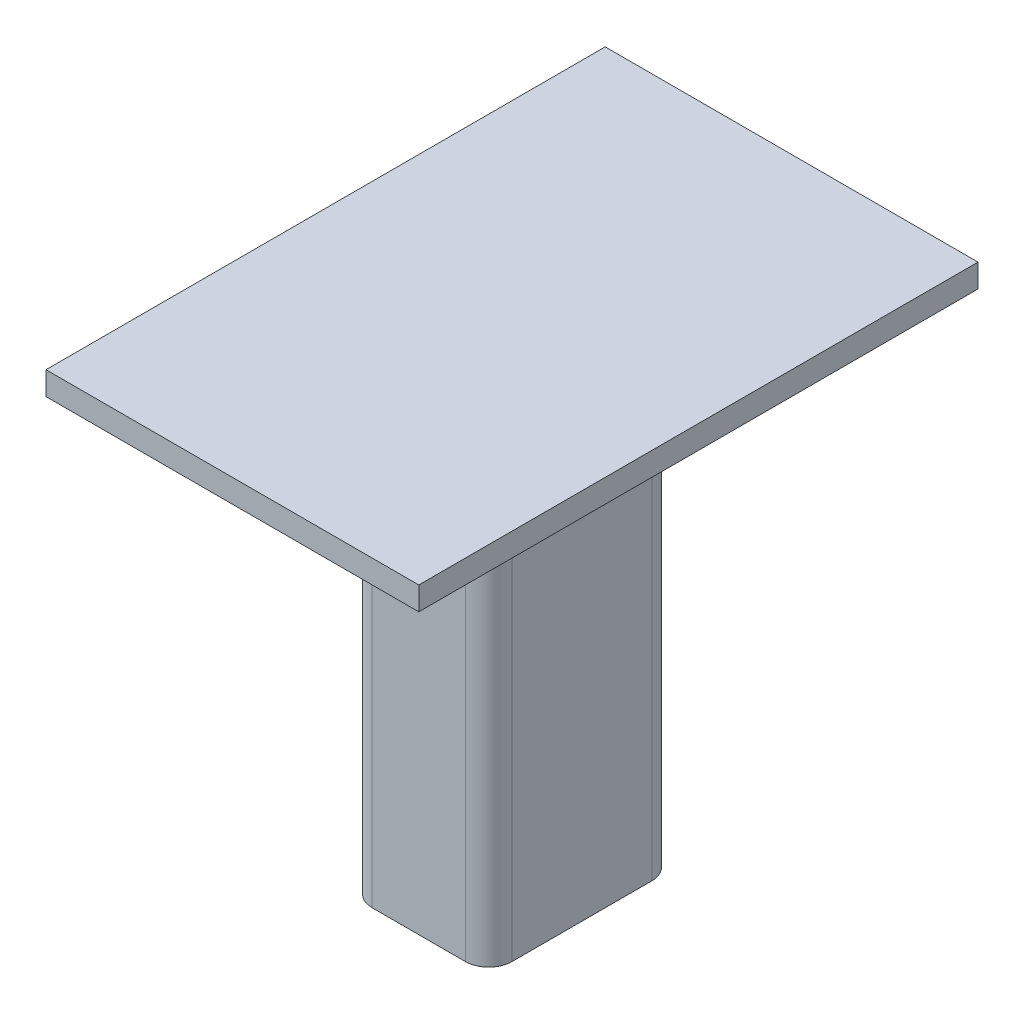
ISO-10303-21;
HEADER;
FILE_DESCRIPTION(('STEP AP214'),'2;1');
FILE_NAME('part.step','',(''),(''),'','','');
FILE_SCHEMA(('AUTOMOTIVE_DESIGN { 1 0 10303 214 1 1 1 1 }'));
ENDSEC;
DATA;
#1=APPLICATION_CONTEXT('core data for automotive mechanical design processes');
#2=APPLICATION_PROTOCOL_DEFINITION('international standard','automotive_design',2000,#1);
#3=PRODUCT_CONTEXT('',#1,'mechanical');
#4=PRODUCT('Part','Part','',(#3));
#5=PRODUCT_RELATED_PRODUCT_CATEGORY('part','',(#4));
#6=PRODUCT_DEFINITION_FORMATION('','',#4);
#7=PRODUCT_DEFINITION_CONTEXT('part definition',#1,'design');
#8=PRODUCT_DEFINITION('design','',#6,#7);
#9=PRODUCT_DEFINITION_SHAPE('','',#8);
#10=(LENGTH_UNIT() NAMED_UNIT(*) SI_UNIT(.MILLI.,.METRE.));
#11=(NAMED_UNIT(*) PLANE_ANGLE_UNIT() SI_UNIT($,.RADIAN.));
#12=(NAMED_UNIT(*) SI_UNIT($,.STERADIAN.) SOLID_ANGLE_UNIT());
#13=UNCERTAINTY_MEASURE_WITH_UNIT(LENGTH_MEASURE(1.E-05),#10,'distance_accuracy_value','');
#14=(GEOMETRIC_REPRESENTATION_CONTEXT(3) GLOBAL_UNCERTAINTY_ASSIGNED_CONTEXT((#13)) GLOBAL_UNIT_ASSIGNED_CONTEXT((#10,
#11,#12)) REPRESENTATION_CONTEXT('',''));
#15=CARTESIAN_POINT('',(0.,0.,0.));
#16=DIRECTION('',(0.,0.,1.));
#17=DIRECTION('',(1.,0.,0.));
#18=AXIS2_PLACEMENT_3D('',#15,#16,#17);
#19=CARTESIAN_POINT('',(101.6,266.7,-152.4));
#20=DIRECTION('',(-1.,0.,0.));
#21=DIRECTION('',(0.,0.,1.));
#22=AXIS2_PLACEMENT_3D('',#19,#20,#21);
#23=PLANE('',#22);
#24=DIRECTION('',(0.,0.,-1.));
#25=VECTOR('',#24,1.);
#26=CARTESIAN_POINT('',(101.6,254.,-152.4));
#27=LINE('',#26,#25);
#28=CARTESIAN_POINT('',(101.6,254.,152.4));
#29=VERTEX_POINT('',#28);
#30=CARTESIAN_POINT('',(101.6,254.,-152.4));
#31=VERTEX_POINT('',#30);
#32=EDGE_CURVE('E109',#29,#31,#27,.T.);
#33=ORIENTED_EDGE('',*,*,#32,.T.);
#34=DIRECTION('',(0.,-1.,0.));
#35=VECTOR('',#34,1.);
#36=CARTESIAN_POINT('',(101.6,266.7,-152.4));
#37=LINE('',#36,#35);
#38=CARTESIAN_POINT('',(101.6,266.7,-152.4));
#39=VERTEX_POINT('',#38);
#40=EDGE_CURVE('E12',#39,#31,#37,.T.);
#41=ORIENTED_EDGE('',*,*,#40,.F.);
#42=DIRECTION('',(0.,0.,-1.));
#43=VECTOR('',#42,1.);
#44=CARTESIAN_POINT('',(101.6,266.7,-152.4));
#45=LINE('',#44,#43);
#46=CARTESIAN_POINT('',(101.6,266.7,152.4));
#47=VERTEX_POINT('',#46);
#48=EDGE_CURVE('E97',#47,#39,#45,.T.);
#49=ORIENTED_EDGE('',*,*,#48,.F.);
#50=DIRECTION('',(0.,-1.,0.));
#51=VECTOR('',#50,1.);
#52=CARTESIAN_POINT('',(101.6,266.7,152.4));
#53=LINE('',#52,#51);
#54=EDGE_CURVE('E105',#47,#29,#53,.T.);
#55=ORIENTED_EDGE('',*,*,#54,.T.);
#56=EDGE_LOOP('',(#33,#41,#49,#55));
#57=FACE_BOUND('',#56,.T.);
#58=ADVANCED_FACE('F46',(#57),#23,.F.);
#59=CARTESIAN_POINT('',(-101.6,266.7,-152.4));
#60=DIRECTION('',(0.,0.,1.));
#61=DIRECTION('',(1.,0.,0.));
#62=AXIS2_PLACEMENT_3D('',#59,#60,#61);
#63=PLANE('',#62);
#64=DIRECTION('',(-1.,0.,0.));
#65=VECTOR('',#64,1.);
#66=CARTESIAN_POINT('',(-101.6,254.,-152.4));
#67=LINE('',#66,#65);
#68=CARTESIAN_POINT('',(-101.6,254.,-152.4));
#69=VERTEX_POINT('',#68);
#70=EDGE_CURVE('E101',#31,#69,#67,.T.);
#71=ORIENTED_EDGE('',*,*,#70,.T.);
#72=DIRECTION('',(0.,-1.,0.));
#73=VECTOR('',#72,1.);
#74=CARTESIAN_POINT('',(-101.6,266.7,-152.4));
#75=LINE('',#74,#73);
#76=CARTESIAN_POINT('',(-101.6,266.7,-152.4));
#77=VERTEX_POINT('',#76);
#78=EDGE_CURVE('E54',#77,#69,#75,.T.);
#79=ORIENTED_EDGE('',*,*,#78,.F.);
#80=DIRECTION('',(-1.,0.,0.));
#81=VECTOR('',#80,1.);
#82=CARTESIAN_POINT('',(-101.6,266.7,-152.4));
#83=LINE('',#82,#81);
#84=EDGE_CURVE('E92',#39,#77,#83,.T.);
#85=ORIENTED_EDGE('',*,*,#84,.F.);
#86=ORIENTED_EDGE('',*,*,#40,.T.);
#87=EDGE_LOOP('',(#71,#79,#85,#86));
#88=FACE_BOUND('',#87,.T.);
#89=ADVANCED_FACE('F100',(#88),#63,.F.);
#90=CARTESIAN_POINT('',(-101.6,266.7,-152.4));
#91=DIRECTION('',(1.,0.,0.));
#92=DIRECTION('',(0.,0.,-1.));
#93=AXIS2_PLACEMENT_3D('',#90,#91,#92);
#94=PLANE('',#93);
#95=DIRECTION('',(0.,0.,1.));
#96=VECTOR('',#95,1.);
#97=CARTESIAN_POINT('',(-101.6,254.,-152.4));
#98=LINE('',#97,#96);
#99=CARTESIAN_POINT('',(-101.6,254.,152.4));
#100=VERTEX_POINT('',#99);
#101=EDGE_CURVE('E79',#69,#100,#98,.T.);
#102=ORIENTED_EDGE('',*,*,#101,.T.);
#103=DIRECTION('',(0.,-1.,0.));
#104=VECTOR('',#103,1.);
#105=CARTESIAN_POINT('',(-101.6,266.7,152.4));
#106=LINE('',#105,#104);
#107=CARTESIAN_POINT('',(-101.6,266.7,152.4));
#108=VERTEX_POINT('',#107);
#109=EDGE_CURVE('E102',#108,#100,#106,.T.);
#110=ORIENTED_EDGE('',*,*,#109,.F.);
#111=DIRECTION('',(0.,0.,1.));
#112=VECTOR('',#111,1.);
#113=CARTESIAN_POINT('',(-101.6,266.7,-152.4));
#114=LINE('',#113,#112);
#115=EDGE_CURVE('E95',#77,#108,#114,.T.);
#116=ORIENTED_EDGE('',*,*,#115,.F.);
#117=ORIENTED_EDGE('',*,*,#78,.T.);
#118=EDGE_LOOP('',(#102,#110,#116,#117));
#119=FACE_BOUND('',#118,.T.);
#120=ADVANCED_FACE('F103',(#119),#94,.F.);
#121=CARTESIAN_POINT('',(-101.6,266.7,152.4));
#122=DIRECTION('',(0.,0.,-1.));
#123=DIRECTION('',(-1.,0.,0.));
#124=AXIS2_PLACEMENT_3D('',#121,#122,#123);
#125=PLANE('',#124);
#126=DIRECTION('',(1.,0.,0.));
#127=VECTOR('',#126,1.);
#128=CARTESIAN_POINT('',(-101.6,254.,152.4));
#129=LINE('',#128,#127);
#130=EDGE_CURVE('E85',#100,#29,#129,.T.);
#131=ORIENTED_EDGE('',*,*,#130,.T.);
#132=ORIENTED_EDGE('',*,*,#54,.F.);
#133=DIRECTION('',(1.,0.,0.));
#134=VECTOR('',#133,1.);
#135=CARTESIAN_POINT('',(-101.6,266.7,152.4));
#136=LINE('',#135,#134);
#137=EDGE_CURVE('E62',#108,#47,#136,.T.);
#138=ORIENTED_EDGE('',*,*,#137,.F.);
#139=ORIENTED_EDGE('',*,*,#109,.T.);
#140=EDGE_LOOP('',(#131,#132,#138,#139));
#141=FACE_BOUND('',#140,.T.);
#142=ADVANCED_FACE('F116',(#141),#125,.F.);
#143=CARTESIAN_POINT('',(101.6,266.7,152.4));
#144=DIRECTION('',(0.,1.,0.));
#145=DIRECTION('',(0.,0.,1.));
#146=AXIS2_PLACEMENT_3D('',#143,#144,#145);
#147=PLANE('',#146);
#148=ORIENTED_EDGE('',*,*,#48,.T.);
#149=ORIENTED_EDGE('',*,*,#84,.T.);
#150=ORIENTED_EDGE('',*,*,#115,.T.);
#151=ORIENTED_EDGE('',*,*,#137,.T.);
#152=EDGE_LOOP('',(#148,#149,#150,#151));
#153=FACE_BOUND('',#152,.T.);
#154=ADVANCED_FACE('F93',(#153),#147,.T.);
#155=CARTESIAN_POINT('',(101.6,254.,152.4));
#156=DIRECTION('',(0.,1.,0.));
#157=DIRECTION('',(0.,0.,1.));
#158=AXIS2_PLACEMENT_3D('',#155,#156,#157);
#159=PLANE('',#158);
#160=ORIENTED_EDGE('',*,*,#32,.F.);
#161=ORIENTED_EDGE('',*,*,#130,.F.);
#162=ORIENTED_EDGE('',*,*,#101,.F.);
#163=ORIENTED_EDGE('',*,*,#70,.F.);
#164=EDGE_LOOP('',(#160,#161,#162,#163));
#165=FACE_BOUND('',#164,.T.);
#166=ADVANCED_FACE('F119',(#165),#159,.F.);
#167=CLOSED_SHELL('',(#58,#89,#120,#142,#154,#166));
#168=MANIFOLD_SOLID_BREP('B2',#167);
#169=CARTESIAN_POINT('',(-25.4,254.,38.1));
#170=DIRECTION('',(0.,-1.,0.));
#171=DIRECTION('',(0.,0.,-1.));
#172=AXIS2_PLACEMENT_3D('',#169,#170,#171);
#173=CYLINDRICAL_SURFACE('',#172,12.7);
#174=CARTESIAN_POINT('',(-25.4,0.,38.1));
#175=DIRECTION('',(0.,1.,0.));
#176=DIRECTION('',(0.,0.,1.));
#177=AXIS2_PLACEMENT_3D('',#174,#175,#176);
#178=CIRCLE('',#177,12.7);
#179=CARTESIAN_POINT('',(-38.1,0.,38.1));
#180=VERTEX_POINT('',#179);
#181=CARTESIAN_POINT('',(-25.4,0.,50.8));
#182=VERTEX_POINT('',#181);
#183=EDGE_CURVE('E324',#180,#182,#178,.T.);
#184=ORIENTED_EDGE('',*,*,#183,.T.);
#185=DIRECTION('',(0.,-1.,0.));
#186=VECTOR('',#185,1.);
#187=CARTESIAN_POINT('',(-25.4,254.,50.8));
#188=LINE('',#187,#186);
#189=CARTESIAN_POINT('',(-25.4,254.,50.8));
#190=VERTEX_POINT('',#189);
#191=EDGE_CURVE('E44',#190,#182,#188,.T.);
#192=ORIENTED_EDGE('',*,*,#191,.F.);
#193=CARTESIAN_POINT('',(-25.4,254.,38.1));
#194=DIRECTION('',(0.,1.,0.));
#195=DIRECTION('',(0.,0.,1.));
#196=AXIS2_PLACEMENT_3D('',#193,#194,#195);
#197=CIRCLE('',#196,12.7);
#198=CARTESIAN_POINT('',(-38.1,254.,38.1));
#199=VERTEX_POINT('',#198);
#200=EDGE_CURVE('E362',#199,#190,#197,.T.);
#201=ORIENTED_EDGE('',*,*,#200,.F.);
#202=DIRECTION('',(0.,-1.,0.));
#203=VECTOR('',#202,1.);
#204=CARTESIAN_POINT('',(-38.1,254.,38.1));
#205=LINE('',#204,#203);
#206=EDGE_CURVE('E294',#199,#180,#205,.T.);
#207=ORIENTED_EDGE('',*,*,#206,.T.);
#208=EDGE_LOOP('',(#184,#192,#201,#207));
#209=FACE_BOUND('',#208,.T.);
#210=ADVANCED_FACE('F169',(#209),#173,.T.);
#211=CARTESIAN_POINT('',(-25.4,254.,50.8));
#212=DIRECTION('',(0.,0.,-1.));
#213=DIRECTION('',(-1.,0.,0.));
#214=AXIS2_PLACEMENT_3D('',#211,#212,#213);
#215=PLANE('',#214);
#216=DIRECTION('',(1.,0.,0.));
#217=VECTOR('',#216,1.);
#218=CARTESIAN_POINT('',(-25.4,0.,50.8));
#219=LINE('',#218,#217);
#220=CARTESIAN_POINT('',(25.4,0.,50.8));
#221=VERTEX_POINT('',#220);
#222=EDGE_CURVE('E327',#182,#221,#219,.T.);
#223=ORIENTED_EDGE('',*,*,#222,.T.);
#224=DIRECTION('',(0.,-1.,0.));
#225=VECTOR('',#224,1.);
#226=CARTESIAN_POINT('',(25.4,254.,50.8));
#227=LINE('',#226,#225);
#228=CARTESIAN_POINT('',(25.4,254.,50.8));
#229=VERTEX_POINT('',#228);
#230=EDGE_CURVE('E178',#229,#221,#227,.T.);
#231=ORIENTED_EDGE('',*,*,#230,.F.);
#232=DIRECTION('',(1.,0.,0.));
#233=VECTOR('',#232,1.);
#234=CARTESIAN_POINT('',(-25.4,254.,50.8));
#235=LINE('',#234,#233);
#236=EDGE_CURVE('E364',#190,#229,#235,.T.);
#237=ORIENTED_EDGE('',*,*,#236,.F.);
#238=ORIENTED_EDGE('',*,*,#191,.T.);
#239=EDGE_LOOP('',(#223,#231,#237,#238));
#240=FACE_BOUND('',#239,.T.);
#241=ADVANCED_FACE('F438',(#240),#215,.F.);
#242=CARTESIAN_POINT('',(25.4,254.,38.1));
#243=DIRECTION('',(0.,-1.,0.));
#244=DIRECTION('',(0.,0.,-1.));
#245=AXIS2_PLACEMENT_3D('',#242,#243,#244);
#246=CYLINDRICAL_SURFACE('',#245,12.7);
#247=CARTESIAN_POINT('',(25.4,0.,38.1));
#248=DIRECTION('',(0.,1.,0.));
#249=DIRECTION('',(0.,0.,1.));
#250=AXIS2_PLACEMENT_3D('',#247,#248,#249);
#251=CIRCLE('',#250,12.7);
#252=CARTESIAN_POINT('',(38.1,0.,38.1));
#253=VERTEX_POINT('',#252);
#254=EDGE_CURVE('E329',#221,#253,#251,.T.);
#255=ORIENTED_EDGE('',*,*,#254,.T.);
#256=DIRECTION('',(0.,-1.,0.));
#257=VECTOR('',#256,1.);
#258=CARTESIAN_POINT('',(38.1,254.,38.1));
#259=LINE('',#258,#257);
#260=CARTESIAN_POINT('',(38.1,254.,38.1));
#261=VERTEX_POINT('',#260);
#262=EDGE_CURVE('E390',#261,#253,#259,.T.);
#263=ORIENTED_EDGE('',*,*,#262,.F.);
#264=CARTESIAN_POINT('',(25.4,254.,38.1));
#265=DIRECTION('',(0.,1.,0.));
#266=DIRECTION('',(0.,0.,1.));
#267=AXIS2_PLACEMENT_3D('',#264,#265,#266);
#268=CIRCLE('',#267,12.7);
#269=EDGE_CURVE('E366',#229,#261,#268,.T.);
#270=ORIENTED_EDGE('',*,*,#269,.F.);
#271=ORIENTED_EDGE('',*,*,#230,.T.);
#272=EDGE_LOOP('',(#255,#263,#270,#271));
#273=FACE_BOUND('',#272,.T.);
#274=ADVANCED_FACE('F444',(#273),#246,.T.);
#275=CARTESIAN_POINT('',(38.1,254.,-38.1));
#276=DIRECTION('',(-1.,0.,0.));
#277=DIRECTION('',(0.,0.,1.));
#278=AXIS2_PLACEMENT_3D('',#275,#276,#277);
#279=PLANE('',#278);
#280=DIRECTION('',(0.,0.,-1.));
#281=VECTOR('',#280,1.);
#282=CARTESIAN_POINT('',(38.1,0.,-38.1));
#283=LINE('',#282,#281);
#284=CARTESIAN_POINT('',(38.1,0.,-38.1));
#285=VERTEX_POINT('',#284);
#286=EDGE_CURVE('E331',#253,#285,#283,.T.);
#287=ORIENTED_EDGE('',*,*,#286,.T.);
#288=DIRECTION('',(0.,-1.,0.));
#289=VECTOR('',#288,1.);
#290=CARTESIAN_POINT('',(38.1,254.,-38.1));
#291=LINE('',#290,#289);
#292=CARTESIAN_POINT('',(38.1,254.,-38.1));
#293=VERTEX_POINT('',#292);
#294=EDGE_CURVE('E387',#293,#285,#291,.T.);
#295=ORIENTED_EDGE('',*,*,#294,.F.);
#296=DIRECTION('',(0.,0.,-1.));
#297=VECTOR('',#296,1.);
#298=CARTESIAN_POINT('',(38.1,254.,-38.1));
#299=LINE('',#298,#297);
#300=EDGE_CURVE('E368',#261,#293,#299,.T.);
#301=ORIENTED_EDGE('',*,*,#300,.F.);
#302=ORIENTED_EDGE('',*,*,#262,.T.);
#303=EDGE_LOOP('',(#287,#295,#301,#302));
#304=FACE_BOUND('',#303,.T.);
#305=ADVANCED_FACE('F578',(#304),#279,.F.);
#306=CARTESIAN_POINT('',(25.4,254.,-38.1));
#307=DIRECTION('',(0.,-1.,0.));
#308=DIRECTION('',(0.,0.,-1.));
#309=AXIS2_PLACEMENT_3D('',#306,#307,#308);
#310=CYLINDRICAL_SURFACE('',#309,12.7);
#311=CARTESIAN_POINT('',(25.4,0.,-38.1));
#312=DIRECTION('',(0.,1.,0.));
#313=DIRECTION('',(0.,0.,1.));
#314=AXIS2_PLACEMENT_3D('',#311,#312,#313);
#315=CIRCLE('',#314,12.7);
#316=CARTESIAN_POINT('',(25.4,0.,-50.8));
#317=VERTEX_POINT('',#316);
#318=EDGE_CURVE('E333',#285,#317,#315,.T.);
#319=ORIENTED_EDGE('',*,*,#318,.T.);
#320=DIRECTION('',(0.,-1.,0.));
#321=VECTOR('',#320,1.);
#322=CARTESIAN_POINT('',(25.4,254.,-50.8));
#323=LINE('',#322,#321);
#324=CARTESIAN_POINT('',(25.4,254.,-50.8));
#325=VERTEX_POINT('',#324);
#326=EDGE_CURVE('E384',#325,#317,#323,.T.);
#327=ORIENTED_EDGE('',*,*,#326,.F.);
#328=CARTESIAN_POINT('',(25.4,254.,-38.1));
#329=DIRECTION('',(0.,1.,0.));
#330=DIRECTION('',(0.,0.,1.));
#331=AXIS2_PLACEMENT_3D('',#328,#329,#330);
#332=CIRCLE('',#331,12.7);
#333=EDGE_CURVE('E370',#293,#325,#332,.T.);
#334=ORIENTED_EDGE('',*,*,#333,.F.);
#335=ORIENTED_EDGE('',*,*,#294,.T.);
#336=EDGE_LOOP('',(#319,#327,#334,#335));
#337=FACE_BOUND('',#336,.T.);
#338=ADVANCED_FACE('F567',(#337),#310,.T.);
#339=CARTESIAN_POINT('',(25.4,254.,-50.8));
#340=DIRECTION('',(0.,0.,1.));
#341=DIRECTION('',(1.,0.,0.));
#342=AXIS2_PLACEMENT_3D('',#339,#340,#341);
#343=PLANE('',#342);
#344=DIRECTION('',(-1.,0.,0.));
#345=VECTOR('',#344,1.);
#346=CARTESIAN_POINT('',(25.4,0.,-50.8));
#347=LINE('',#346,#345);
#348=CARTESIAN_POINT('',(-25.4,0.,-50.8));
#349=VERTEX_POINT('',#348);
#350=EDGE_CURVE('E335',#317,#349,#347,.T.);
#351=ORIENTED_EDGE('',*,*,#350,.T.);
#352=DIRECTION('',(0.,-1.,0.));
#353=VECTOR('',#352,1.);
#354=CARTESIAN_POINT('',(-25.4,254.,-50.8));
#355=LINE('',#354,#353);
#356=CARTESIAN_POINT('',(-25.4,254.,-50.8));
#357=VERTEX_POINT('',#356);
#358=EDGE_CURVE('E381',#357,#349,#355,.T.);
#359=ORIENTED_EDGE('',*,*,#358,.F.);
#360=DIRECTION('',(-1.,0.,0.));
#361=VECTOR('',#360,1.);
#362=CARTESIAN_POINT('',(25.4,254.,-50.8));
#363=LINE('',#362,#361);
#364=EDGE_CURVE('E372',#325,#357,#363,.T.);
#365=ORIENTED_EDGE('',*,*,#364,.F.);
#366=ORIENTED_EDGE('',*,*,#326,.T.);
#367=EDGE_LOOP('',(#351,#359,#365,#366));
#368=FACE_BOUND('',#367,.T.);
#369=ADVANCED_FACE('F556',(#368),#343,.F.);
#370=CARTESIAN_POINT('',(-25.4,254.,-38.1));
#371=DIRECTION('',(0.,-1.,0.));
#372=DIRECTION('',(0.,0.,-1.));
#373=AXIS2_PLACEMENT_3D('',#370,#371,#372);
#374=CYLINDRICAL_SURFACE('',#373,12.7);
#375=CARTESIAN_POINT('',(-25.4,0.,-38.1));
#376=DIRECTION('',(0.,1.,0.));
#377=DIRECTION('',(0.,0.,1.));
#378=AXIS2_PLACEMENT_3D('',#375,#376,#377);
#379=CIRCLE('',#378,12.7);
#380=CARTESIAN_POINT('',(-38.1,0.,-38.1));
#381=VERTEX_POINT('',#380);
#382=EDGE_CURVE('E337',#349,#381,#379,.T.);
#383=ORIENTED_EDGE('',*,*,#382,.T.);
#384=DIRECTION('',(0.,-1.,0.));
#385=VECTOR('',#384,1.);
#386=CARTESIAN_POINT('',(-38.1,254.,-38.1));
#387=LINE('',#386,#385);
#388=CARTESIAN_POINT('',(-38.1,254.,-38.1));
#389=VERTEX_POINT('',#388);
#390=EDGE_CURVE('E378',#389,#381,#387,.T.);
#391=ORIENTED_EDGE('',*,*,#390,.F.);
#392=CARTESIAN_POINT('',(-25.4,254.,-38.1));
#393=DIRECTION('',(0.,1.,0.));
#394=DIRECTION('',(0.,0.,1.));
#395=AXIS2_PLACEMENT_3D('',#392,#393,#394);
#396=CIRCLE('',#395,12.7);
#397=EDGE_CURVE('E191',#357,#389,#396,.T.);
#398=ORIENTED_EDGE('',*,*,#397,.F.);
#399=ORIENTED_EDGE('',*,*,#358,.T.);
#400=EDGE_LOOP('',(#383,#391,#398,#399));
#401=FACE_BOUND('',#400,.T.);
#402=ADVANCED_FACE('F548',(#401),#374,.T.);
#403=CARTESIAN_POINT('',(25.4,254.,38.1));
#404=DIRECTION('',(0.,-1.,0.));
#405=DIRECTION('',(0.,0.,-1.));
#406=AXIS2_PLACEMENT_3D('',#403,#404,#405);
#407=CYLINDRICAL_SURFACE('',#406,6.34999999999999);
#408=CARTESIAN_POINT('',(25.4,0.,38.1));
#409=DIRECTION('',(0.,1.,0.));
#410=DIRECTION('',(0.,0.,1.));
#411=AXIS2_PLACEMENT_3D('',#408,#409,#410);
#412=CIRCLE('',#411,6.34999999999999);
#413=CARTESIAN_POINT('',(25.4,0.,44.45));
#414=VERTEX_POINT('',#413);
#415=CARTESIAN_POINT('',(31.75,0.,38.1));
#416=VERTEX_POINT('',#415);
#417=EDGE_CURVE('E297',#414,#416,#412,.T.);
#418=ORIENTED_EDGE('',*,*,#417,.F.);
#419=DIRECTION('',(0.,-1.,0.));
#420=VECTOR('',#419,1.);
#421=CARTESIAN_POINT('',(25.4,254.,44.45));
#422=LINE('',#421,#420);
#423=CARTESIAN_POINT('',(25.4,254.,44.45));
#424=VERTEX_POINT('',#423);
#425=EDGE_CURVE('E173',#424,#414,#422,.T.);
#426=ORIENTED_EDGE('',*,*,#425,.F.);
#427=CARTESIAN_POINT('',(25.4,254.,38.1));
#428=DIRECTION('',(0.,1.,0.));
#429=DIRECTION('',(0.,0.,1.));
#430=AXIS2_PLACEMENT_3D('',#427,#428,#429);
#431=CIRCLE('',#430,6.34999999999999);
#432=CARTESIAN_POINT('',(31.75,254.,38.1));
#433=VERTEX_POINT('',#432);
#434=EDGE_CURVE('E341',#424,#433,#431,.T.);
#435=ORIENTED_EDGE('',*,*,#434,.T.);
#436=DIRECTION('',(0.,-1.,0.));
#437=VECTOR('',#436,1.);
#438=CARTESIAN_POINT('',(31.75,254.,38.1));
#439=LINE('',#438,#437);
#440=EDGE_CURVE('E298',#433,#416,#439,.T.);
#441=ORIENTED_EDGE('',*,*,#440,.T.);
#442=EDGE_LOOP('',(#418,#426,#435,#441));
#443=FACE_BOUND('',#442,.T.);
#444=ADVANCED_FACE('F171',(#443),#407,.F.);
#445=CARTESIAN_POINT('',(-25.4,254.,44.45));
#446=DIRECTION('',(0.,0.,-1.));
#447=DIRECTION('',(-1.,0.,0.));
#448=AXIS2_PLACEMENT_3D('',#445,#446,#447);
#449=PLANE('',#448);
#450=DIRECTION('',(1.,0.,0.));
#451=VECTOR('',#450,1.);
#452=CARTESIAN_POINT('',(-25.4,0.,44.45));
#453=LINE('',#452,#451);
#454=CARTESIAN_POINT('',(-25.4,0.,44.45));
#455=VERTEX_POINT('',#454);
#456=EDGE_CURVE('E287',#455,#414,#453,.T.);
#457=ORIENTED_EDGE('',*,*,#456,.F.);
#458=DIRECTION('',(0.,-1.,0.));
#459=VECTOR('',#458,1.);
#460=CARTESIAN_POINT('',(-25.4,254.,44.45));
#461=LINE('',#460,#459);
#462=CARTESIAN_POINT('',(-25.4,254.,44.45));
#463=VERTEX_POINT('',#462);
#464=EDGE_CURVE('E295',#463,#455,#461,.T.);
#465=ORIENTED_EDGE('',*,*,#464,.F.);
#466=DIRECTION('',(1.,0.,0.));
#467=VECTOR('',#466,1.);
#468=CARTESIAN_POINT('',(-25.4,254.,44.45));
#469=LINE('',#468,#467);
#470=EDGE_CURVE('E290',#463,#424,#469,.T.);
#471=ORIENTED_EDGE('',*,*,#470,.T.);
#472=ORIENTED_EDGE('',*,*,#425,.T.);
#473=EDGE_LOOP('',(#457,#465,#471,#472));
#474=FACE_BOUND('',#473,.T.);
#475=ADVANCED_FACE('F285',(#474),#449,.T.);
#476=CARTESIAN_POINT('',(-25.4,254.,38.1));
#477=DIRECTION('',(0.,-1.,0.));
#478=DIRECTION('',(0.,0.,-1.));
#479=AXIS2_PLACEMENT_3D('',#476,#477,#478);
#480=CYLINDRICAL_SURFACE('',#479,6.34999999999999);
#481=CARTESIAN_POINT('',(-25.4,0.,38.1));
#482=DIRECTION('',(0.,1.,0.));
#483=DIRECTION('',(0.,0.,1.));
#484=AXIS2_PLACEMENT_3D('',#481,#482,#483);
#485=CIRCLE('',#484,6.34999999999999);
#486=CARTESIAN_POINT('',(-31.75,0.,38.1));
#487=VERTEX_POINT('',#486);
#488=EDGE_CURVE('E307',#487,#455,#485,.T.);
#489=ORIENTED_EDGE('',*,*,#488,.F.);
#490=DIRECTION('',(0.,-1.,0.));
#491=VECTOR('',#490,1.);
#492=CARTESIAN_POINT('',(-31.75,254.,38.1));
#493=LINE('',#492,#491);
#494=CARTESIAN_POINT('',(-31.75,254.,38.1));
#495=VERTEX_POINT('',#494);
#496=EDGE_CURVE('E404',#495,#487,#493,.T.);
#497=ORIENTED_EDGE('',*,*,#496,.F.);
#498=CARTESIAN_POINT('',(-25.4,254.,38.1));
#499=DIRECTION('',(0.,1.,0.));
#500=DIRECTION('',(0.,0.,1.));
#501=AXIS2_PLACEMENT_3D('',#498,#499,#500);
#502=CIRCLE('',#501,6.34999999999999);
#503=EDGE_CURVE('E344',#495,#463,#502,.T.);
#504=ORIENTED_EDGE('',*,*,#503,.T.);
#505=ORIENTED_EDGE('',*,*,#464,.T.);
#506=EDGE_LOOP('',(#489,#497,#504,#505));
#507=FACE_BOUND('',#506,.T.);
#508=ADVANCED_FACE('F406',(#507),#480,.F.);
#509=CARTESIAN_POINT('',(-31.75,254.,38.1));
#510=DIRECTION('',(1.,0.,0.));
#511=DIRECTION('',(0.,0.,-1.));
#512=AXIS2_PLACEMENT_3D('',#509,#510,#511);
#513=PLANE('',#512);
#514=DIRECTION('',(0.,0.,1.));
#515=VECTOR('',#514,1.);
#516=CARTESIAN_POINT('',(-31.75,0.,38.1));
#517=LINE('',#516,#515);
#518=CARTESIAN_POINT('',(-31.75,0.,-38.1));
#519=VERTEX_POINT('',#518);
#520=EDGE_CURVE('E309',#519,#487,#517,.T.);
#521=ORIENTED_EDGE('',*,*,#520,.F.);
#522=DIRECTION('',(0.,-1.,0.));
#523=VECTOR('',#522,1.);
#524=CARTESIAN_POINT('',(-31.75,254.,-38.1));
#525=LINE('',#524,#523);
#526=CARTESIAN_POINT('',(-31.75,254.,-38.1));
#527=VERTEX_POINT('',#526);
#528=EDGE_CURVE('E402',#527,#519,#525,.T.);
#529=ORIENTED_EDGE('',*,*,#528,.F.);
#530=DIRECTION('',(0.,0.,1.));
#531=VECTOR('',#530,1.);
#532=CARTESIAN_POINT('',(-31.75,254.,38.1));
#533=LINE('',#532,#531);
#534=EDGE_CURVE('E347',#527,#495,#533,.T.);
#535=ORIENTED_EDGE('',*,*,#534,.T.);
#536=ORIENTED_EDGE('',*,*,#496,.T.);
#537=EDGE_LOOP('',(#521,#529,#535,#536));
#538=FACE_BOUND('',#537,.T.);
#539=ADVANCED_FACE('F428',(#538),#513,.T.);
#540=CARTESIAN_POINT('',(-25.4,254.,-38.1));
#541=DIRECTION('',(0.,-1.,0.));
#542=DIRECTION('',(0.,0.,-1.));
#543=AXIS2_PLACEMENT_3D('',#540,#541,#542);
#544=CYLINDRICAL_SURFACE('',#543,6.34999999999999);
#545=CARTESIAN_POINT('',(-25.4,0.,-38.1));
#546=DIRECTION('',(0.,1.,0.));
#547=DIRECTION('',(0.,0.,1.));
#548=AXIS2_PLACEMENT_3D('',#545,#546,#547);
#549=CIRCLE('',#548,6.34999999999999);
#550=CARTESIAN_POINT('',(-25.4,0.,-44.45));
#551=VERTEX_POINT('',#550);
#552=EDGE_CURVE('E313',#551,#519,#549,.T.);
#553=ORIENTED_EDGE('',*,*,#552,.F.);
#554=DIRECTION('',(0.,-1.,0.));
#555=VECTOR('',#554,1.);
#556=CARTESIAN_POINT('',(-25.4,254.,-44.45));
#557=LINE('',#556,#555);
#558=CARTESIAN_POINT('',(-25.4,254.,-44.45));
#559=VERTEX_POINT('',#558);
#560=EDGE_CURVE('E400',#559,#551,#557,.T.);
#561=ORIENTED_EDGE('',*,*,#560,.F.);
#562=CARTESIAN_POINT('',(-25.4,254.,-38.1));
#563=DIRECTION('',(0.,1.,0.));
#564=DIRECTION('',(0.,0.,1.));
#565=AXIS2_PLACEMENT_3D('',#562,#563,#564);
#566=CIRCLE('',#565,6.34999999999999);
#567=EDGE_CURVE('E350',#559,#527,#566,.T.);
#568=ORIENTED_EDGE('',*,*,#567,.T.);
#569=ORIENTED_EDGE('',*,*,#528,.T.);
#570=EDGE_LOOP('',(#553,#561,#568,#569));
#571=FACE_BOUND('',#570,.T.);
#572=ADVANCED_FACE('F425',(#571),#544,.F.);
#573=CARTESIAN_POINT('',(25.4,254.,-44.45));
#574=DIRECTION('',(0.,0.,1.));
#575=DIRECTION('',(1.,0.,0.));
#576=AXIS2_PLACEMENT_3D('',#573,#574,#575);
#577=PLANE('',#576);
#578=DIRECTION('',(-1.,0.,0.));
#579=VECTOR('',#578,1.);
#580=CARTESIAN_POINT('',(25.4,0.,-44.45));
#581=LINE('',#580,#579);
#582=CARTESIAN_POINT('',(25.4,0.,-44.45));
#583=VERTEX_POINT('',#582);
#584=EDGE_CURVE('E316',#583,#551,#581,.T.);
#585=ORIENTED_EDGE('',*,*,#584,.F.);
#586=DIRECTION('',(0.,-1.,0.));
#587=VECTOR('',#586,1.);
#588=CARTESIAN_POINT('',(25.4,254.,-44.45));
#589=LINE('',#588,#587);
#590=CARTESIAN_POINT('',(25.4,254.,-44.45));
#591=VERTEX_POINT('',#590);
#592=EDGE_CURVE('E398',#591,#583,#589,.T.);
#593=ORIENTED_EDGE('',*,*,#592,.F.);
#594=DIRECTION('',(-1.,0.,0.));
#595=VECTOR('',#594,1.);
#596=CARTESIAN_POINT('',(25.4,254.,-44.45));
#597=LINE('',#596,#595);
#598=EDGE_CURVE('E353',#591,#559,#597,.T.);
#599=ORIENTED_EDGE('',*,*,#598,.T.);
#600=ORIENTED_EDGE('',*,*,#560,.T.);
#601=EDGE_LOOP('',(#585,#593,#599,#600));
#602=FACE_BOUND('',#601,.T.);
#603=ADVANCED_FACE('F421',(#602),#577,.T.);
#604=CARTESIAN_POINT('',(25.4,254.,-38.1));
#605=DIRECTION('',(0.,-1.,0.));
#606=DIRECTION('',(0.,0.,-1.));
#607=AXIS2_PLACEMENT_3D('',#604,#605,#606);
#608=CYLINDRICAL_SURFACE('',#607,6.34999999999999);
#609=CARTESIAN_POINT('',(25.4,0.,-38.1));
#610=DIRECTION('',(0.,1.,0.));
#611=DIRECTION('',(0.,0.,1.));
#612=AXIS2_PLACEMENT_3D('',#609,#610,#611);
#613=CIRCLE('',#612,6.34999999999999);
#614=CARTESIAN_POINT('',(31.75,0.,-38.1));
#615=VERTEX_POINT('',#614);
#616=EDGE_CURVE('E319',#615,#583,#613,.T.);
#617=ORIENTED_EDGE('',*,*,#616,.F.);
#618=DIRECTION('',(0.,-1.,0.));
#619=VECTOR('',#618,1.);
#620=CARTESIAN_POINT('',(31.75,254.,-38.1));
#621=LINE('',#620,#619);
#622=CARTESIAN_POINT('',(31.75,254.,-38.1));
#623=VERTEX_POINT('',#622);
#624=EDGE_CURVE('E396',#623,#615,#621,.T.);
#625=ORIENTED_EDGE('',*,*,#624,.F.);
#626=CARTESIAN_POINT('',(25.4,254.,-38.1));
#627=DIRECTION('',(0.,1.,0.));
#628=DIRECTION('',(0.,0.,1.));
#629=AXIS2_PLACEMENT_3D('',#626,#627,#628);
#630=CIRCLE('',#629,6.34999999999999);
#631=EDGE_CURVE('E356',#623,#591,#630,.T.);
#632=ORIENTED_EDGE('',*,*,#631,.T.);
#633=ORIENTED_EDGE('',*,*,#592,.T.);
#634=EDGE_LOOP('',(#617,#625,#632,#633));
#635=FACE_BOUND('',#634,.T.);
#636=ADVANCED_FACE('F419',(#635),#608,.F.);
#637=CARTESIAN_POINT('',(31.75,254.,-38.1));
#638=DIRECTION('',(-1.,0.,0.));
#639=DIRECTION('',(0.,0.,1.));
#640=AXIS2_PLACEMENT_3D('',#637,#638,#639);
#641=PLANE('',#640);
#642=DIRECTION('',(0.,0.,-1.));
#643=VECTOR('',#642,1.);
#644=CARTESIAN_POINT('',(31.75,0.,-38.1));
#645=LINE('',#644,#643);
#646=EDGE_CURVE('E322',#416,#615,#645,.T.);
#647=ORIENTED_EDGE('',*,*,#646,.F.);
#648=ORIENTED_EDGE('',*,*,#440,.F.);
#649=DIRECTION('',(0.,0.,-1.));
#650=VECTOR('',#649,1.);
#651=CARTESIAN_POINT('',(31.75,254.,-38.1));
#652=LINE('',#651,#650);
#653=EDGE_CURVE('E359',#433,#623,#652,.T.);
#654=ORIENTED_EDGE('',*,*,#653,.T.);
#655=ORIENTED_EDGE('',*,*,#624,.T.);
#656=EDGE_LOOP('',(#647,#648,#654,#655));
#657=FACE_BOUND('',#656,.T.);
#658=ADVANCED_FACE('F415',(#657),#641,.T.);
#659=CARTESIAN_POINT('',(-38.1,254.,38.1));
#660=DIRECTION('',(1.,0.,0.));
#661=DIRECTION('',(0.,0.,-1.));
#662=AXIS2_PLACEMENT_3D('',#659,#660,#661);
#663=PLANE('',#662);
#664=DIRECTION('',(0.,0.,1.));
#665=VECTOR('',#664,1.);
#666=CARTESIAN_POINT('',(-38.1,0.,38.1));
#667=LINE('',#666,#665);
#668=EDGE_CURVE('E339',#381,#180,#667,.T.);
#669=ORIENTED_EDGE('',*,*,#668,.T.);
#670=ORIENTED_EDGE('',*,*,#206,.F.);
#671=DIRECTION('',(0.,0.,1.));
#672=VECTOR('',#671,1.);
#673=CARTESIAN_POINT('',(-38.1,254.,38.1));
#674=LINE('',#673,#672);
#675=EDGE_CURVE('E186',#389,#199,#674,.T.);
#676=ORIENTED_EDGE('',*,*,#675,.F.);
#677=ORIENTED_EDGE('',*,*,#390,.T.);
#678=EDGE_LOOP('',(#669,#670,#676,#677));
#679=FACE_BOUND('',#678,.T.);
#680=ADVANCED_FACE('F451',(#679),#663,.F.);
#681=CARTESIAN_POINT('',(-25.4,254.,38.1));
#682=DIRECTION('',(0.,1.,0.));
#683=DIRECTION('',(0.,0.,1.));
#684=AXIS2_PLACEMENT_3D('',#681,#682,#683);
#685=PLANE('',#684);
#686=ORIENTED_EDGE('',*,*,#434,.F.);
#687=ORIENTED_EDGE('',*,*,#470,.F.);
#688=ORIENTED_EDGE('',*,*,#503,.F.);
#689=ORIENTED_EDGE('',*,*,#534,.F.);
#690=ORIENTED_EDGE('',*,*,#567,.F.);
#691=ORIENTED_EDGE('',*,*,#598,.F.);
#692=ORIENTED_EDGE('',*,*,#631,.F.);
#693=ORIENTED_EDGE('',*,*,#653,.F.);
#694=EDGE_LOOP('',(#686,#687,#688,#689,#690,#691,#692,#693));
#695=FACE_BOUND('',#694,.T.);
#696=ORIENTED_EDGE('',*,*,#200,.T.);
#697=ORIENTED_EDGE('',*,*,#236,.T.);
#698=ORIENTED_EDGE('',*,*,#269,.T.);
#699=ORIENTED_EDGE('',*,*,#300,.T.);
#700=ORIENTED_EDGE('',*,*,#333,.T.);
#701=ORIENTED_EDGE('',*,*,#364,.T.);
#702=ORIENTED_EDGE('',*,*,#397,.T.);
#703=ORIENTED_EDGE('',*,*,#675,.T.);
#704=EDGE_LOOP('',(#696,#697,#698,#699,#700,#701,#702,#703));
#705=FACE_BOUND('',#704,.T.);
#706=ADVANCED_FACE('F409',(#695,#705),#685,.T.);
#707=CARTESIAN_POINT('',(-25.4,0.,38.1));
#708=DIRECTION('',(0.,1.,0.));
#709=DIRECTION('',(0.,0.,1.));
#710=AXIS2_PLACEMENT_3D('',#707,#708,#709);
#711=PLANE('',#710);
#712=ORIENTED_EDGE('',*,*,#417,.T.);
#713=ORIENTED_EDGE('',*,*,#646,.T.);
#714=ORIENTED_EDGE('',*,*,#616,.T.);
#715=ORIENTED_EDGE('',*,*,#584,.T.);
#716=ORIENTED_EDGE('',*,*,#552,.T.);
#717=ORIENTED_EDGE('',*,*,#520,.T.);
#718=ORIENTED_EDGE('',*,*,#488,.T.);
#719=ORIENTED_EDGE('',*,*,#456,.T.);
#720=EDGE_LOOP('',(#712,#713,#714,#715,#716,#717,#718,#719));
#721=FACE_BOUND('',#720,.T.);
#722=ORIENTED_EDGE('',*,*,#183,.F.);
#723=ORIENTED_EDGE('',*,*,#668,.F.);
#724=ORIENTED_EDGE('',*,*,#382,.F.);
#725=ORIENTED_EDGE('',*,*,#350,.F.);
#726=ORIENTED_EDGE('',*,*,#318,.F.);
#727=ORIENTED_EDGE('',*,*,#286,.F.);
#728=ORIENTED_EDGE('',*,*,#254,.F.);
#729=ORIENTED_EDGE('',*,*,#222,.F.);
#730=EDGE_LOOP('',(#722,#723,#724,#725,#726,#727,#728,#729));
#731=FACE_BOUND('',#730,.T.);
#732=ADVANCED_FACE('F303',(#721,#731),#711,.F.);
#733=CLOSED_SHELL('',(#210,#241,#274,#305,#338,#369,#402,#444,#475,#508,#539,#572,#603,#636,
#658,#680,#706,#732));
#734=MANIFOLD_SOLID_BREP('B6',#733);
#735=ADVANCED_BREP_SHAPE_REPRESENTATION('',(#18,#168,#734),#14);
#736=SHAPE_DEFINITION_REPRESENTATION(#9,#735);
ENDSEC;
END-ISO-10303-21;
